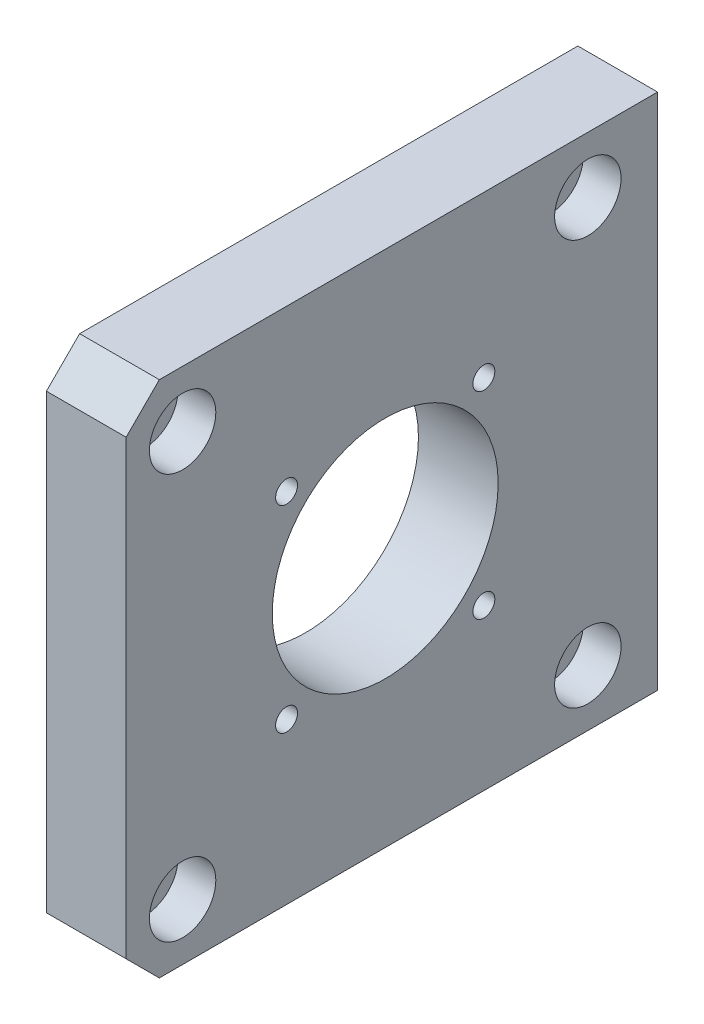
ISO-10303-21;
HEADER;
FILE_DESCRIPTION(('STEP AP214'),'2;1');
FILE_NAME('part.step','',(''),(''),'','','');
FILE_SCHEMA(('AUTOMOTIVE_DESIGN { 1 0 10303 214 1 1 1 1 }'));
ENDSEC;
DATA;
#1=APPLICATION_CONTEXT('core data for automotive mechanical design processes');
#2=APPLICATION_PROTOCOL_DEFINITION('international standard','automotive_design',2000,#1);
#3=PRODUCT_CONTEXT('',#1,'mechanical');
#4=PRODUCT('Part','Part','',(#3));
#5=PRODUCT_RELATED_PRODUCT_CATEGORY('part','',(#4));
#6=PRODUCT_DEFINITION_FORMATION('','',#4);
#7=PRODUCT_DEFINITION_CONTEXT('part definition',#1,'design');
#8=PRODUCT_DEFINITION('design','',#6,#7);
#9=PRODUCT_DEFINITION_SHAPE('','',#8);
#10=(LENGTH_UNIT() NAMED_UNIT(*) SI_UNIT(.MILLI.,.METRE.));
#11=(NAMED_UNIT(*) PLANE_ANGLE_UNIT() SI_UNIT($,.RADIAN.));
#12=(NAMED_UNIT(*) SI_UNIT($,.STERADIAN.) SOLID_ANGLE_UNIT());
#13=UNCERTAINTY_MEASURE_WITH_UNIT(LENGTH_MEASURE(1.E-05),#10,'distance_accuracy_value','');
#14=(GEOMETRIC_REPRESENTATION_CONTEXT(3) GLOBAL_UNCERTAINTY_ASSIGNED_CONTEXT((#13)) GLOBAL_UNIT_ASSIGNED_CONTEXT((#10,
#11,#12)) REPRESENTATION_CONTEXT('',''));
#15=CARTESIAN_POINT('',(0.,0.,0.));
#16=DIRECTION('',(0.,0.,1.));
#17=DIRECTION('',(1.,0.,0.));
#18=AXIS2_PLACEMENT_3D('',#15,#16,#17);
#19=CARTESIAN_POINT('',(-224.959018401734,-81.8968532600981,80.));
#20=DIRECTION('',(1.,0.,0.));
#21=DIRECTION('',(0.,0.,-1.));
#22=AXIS2_PLACEMENT_3D('',#19,#20,#21);
#23=PLANE('',#22);
#24=CARTESIAN_POINT('',(-224.959018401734,-12.3968532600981,71.5));
#25=DIRECTION('',(1.,0.,0.));
#26=DIRECTION('',(0.,0.,-1.));
#27=AXIS2_PLACEMENT_3D('',#24,#25,#26);
#28=CIRCLE('',#27,2.75);
#29=CARTESIAN_POINT('',(-224.959018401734,-12.3968532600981,68.75));
#30=VERTEX_POINT('',#29);
#31=EDGE_CURVE('E544',#30,#30,#28,.T.);
#32=ORIENTED_EDGE('',*,*,#31,.T.);
#33=EDGE_LOOP('',(#32));
#34=FACE_BOUND('',#33,.T.);
#35=CARTESIAN_POINT('',(-224.959018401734,-73.3968532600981,71.5));
#36=DIRECTION('',(1.,0.,0.));
#37=DIRECTION('',(0.,0.,-1.));
#38=AXIS2_PLACEMENT_3D('',#35,#36,#37);
#39=CIRCLE('',#38,2.75);
#40=CARTESIAN_POINT('',(-224.959018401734,-73.3968532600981,68.75));
#41=VERTEX_POINT('',#40);
#42=EDGE_CURVE('E532',#41,#41,#39,.T.);
#43=ORIENTED_EDGE('',*,*,#42,.T.);
#44=EDGE_LOOP('',(#43));
#45=FACE_BOUND('',#44,.T.);
#46=CARTESIAN_POINT('',(-224.959018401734,-73.3968532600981,10.5));
#47=DIRECTION('',(1.,0.,0.));
#48=DIRECTION('',(0.,0.,-1.));
#49=AXIS2_PLACEMENT_3D('',#46,#47,#48);
#50=CIRCLE('',#49,2.75);
#51=CARTESIAN_POINT('',(-224.959018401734,-73.3968532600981,7.75));
#52=VERTEX_POINT('',#51);
#53=EDGE_CURVE('E520',#52,#52,#50,.T.);
#54=ORIENTED_EDGE('',*,*,#53,.T.);
#55=EDGE_LOOP('',(#54));
#56=FACE_BOUND('',#55,.T.);
#57=CARTESIAN_POINT('',(-224.959018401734,-12.3968532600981,10.5));
#58=DIRECTION('',(1.,0.,0.));
#59=DIRECTION('',(0.,0.,-1.));
#60=AXIS2_PLACEMENT_3D('',#57,#58,#59);
#61=CIRCLE('',#60,2.75);
#62=CARTESIAN_POINT('',(-224.959018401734,-12.3968532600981,7.75));
#63=VERTEX_POINT('',#62);
#64=EDGE_CURVE('E508',#63,#63,#61,.T.);
#65=ORIENTED_EDGE('',*,*,#64,.T.);
#66=EDGE_LOOP('',(#65));
#67=FACE_BOUND('',#66,.T.);
#68=CARTESIAN_POINT('',(-224.959018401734,-28.0476108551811,55.8492422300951));
#69=DIRECTION('',(-1.,0.,0.));
#70=DIRECTION('',(0.,0.,1.));
#71=AXIS2_PLACEMENT_3D('',#68,#69,#70);
#72=CIRCLE('',#71,1.65);
#73=CARTESIAN_POINT('',(-224.959018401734,-28.0476108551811,57.4992422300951));
#74=VERTEX_POINT('',#73);
#75=EDGE_CURVE('E505',#74,#74,#72,.T.);
#76=ORIENTED_EDGE('',*,*,#75,.F.);
#77=EDGE_LOOP('',(#76));
#78=FACE_BOUND('',#77,.T.);
#79=CARTESIAN_POINT('',(-224.959018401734,-57.7460956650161,55.849242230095));
#80=DIRECTION('',(-1.,0.,0.));
#81=DIRECTION('',(0.,0.,1.));
#82=AXIS2_PLACEMENT_3D('',#79,#80,#81);
#83=CIRCLE('',#82,1.65);
#84=CARTESIAN_POINT('',(-224.959018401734,-57.7460956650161,57.499242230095));
#85=VERTEX_POINT('',#84);
#86=EDGE_CURVE('E499',#85,#85,#83,.T.);
#87=ORIENTED_EDGE('',*,*,#86,.F.);
#88=EDGE_LOOP('',(#87));
#89=FACE_BOUND('',#88,.T.);
#90=CARTESIAN_POINT('',(-224.959018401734,-28.047610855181,26.1507574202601));
#91=DIRECTION('',(-1.,0.,0.));
#92=DIRECTION('',(0.,0.,1.));
#93=AXIS2_PLACEMENT_3D('',#90,#91,#92);
#94=CIRCLE('',#93,1.65);
#95=CARTESIAN_POINT('',(-224.959018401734,-28.047610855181,27.8007574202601));
#96=VERTEX_POINT('',#95);
#97=EDGE_CURVE('E493',#96,#96,#94,.T.);
#98=ORIENTED_EDGE('',*,*,#97,.F.);
#99=EDGE_LOOP('',(#98));
#100=FACE_BOUND('',#99,.T.);
#101=CARTESIAN_POINT('',(-224.959018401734,-57.7460956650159,26.15075742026));
#102=DIRECTION('',(-1.,0.,0.));
#103=DIRECTION('',(0.,0.,1.));
#104=AXIS2_PLACEMENT_3D('',#101,#102,#103);
#105=CIRCLE('',#104,1.65);
#106=CARTESIAN_POINT('',(-224.959018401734,-57.7460956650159,27.80075742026));
#107=VERTEX_POINT('',#106);
#108=EDGE_CURVE('E485',#107,#107,#105,.T.);
#109=ORIENTED_EDGE('',*,*,#108,.F.);
#110=EDGE_LOOP('',(#109));
#111=FACE_BOUND('',#110,.T.);
#112=CARTESIAN_POINT('',(-224.959018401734,-42.8968532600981,41.));
#113=DIRECTION('',(1.,0.,0.));
#114=DIRECTION('',(0.,0.,-1.));
#115=AXIS2_PLACEMENT_3D('',#112,#113,#114);
#116=CIRCLE('',#115,17.);
#117=CARTESIAN_POINT('',(-224.959018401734,-42.8968532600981,24.));
#118=VERTEX_POINT('',#117);
#119=EDGE_CURVE('E93',#118,#118,#116,.T.);
#120=ORIENTED_EDGE('',*,*,#119,.T.);
#121=EDGE_LOOP('',(#120));
#122=FACE_BOUND('',#121,.T.);
#123=DIRECTION('',(0.,-1.,0.));
#124=VECTOR('',#123,1.);
#125=CARTESIAN_POINT('',(-224.959018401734,-81.8968532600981,80.));
#126=LINE('',#125,#124);
#127=CARTESIAN_POINT('',(-224.959018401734,-8.8968532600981,80.));
#128=VERTEX_POINT('',#127);
#129=CARTESIAN_POINT('',(-224.959018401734,-76.8968532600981,80.));
#130=VERTEX_POINT('',#129);
#131=EDGE_CURVE('E106',#128,#130,#126,.T.);
#132=ORIENTED_EDGE('',*,*,#131,.F.);
#133=DIRECTION('',(0.,-0.707106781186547,0.707106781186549));
#134=VECTOR('',#133,1.);
#135=CARTESIAN_POINT('',(-224.959018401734,-8.89685326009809,80.));
#136=LINE('',#135,#134);
#137=CARTESIAN_POINT('',(-224.959018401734,-3.89685326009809,75.));
#138=VERTEX_POINT('',#137);
#139=EDGE_CURVE('E139',#128,#138,#136,.F.);
#140=ORIENTED_EDGE('',*,*,#139,.T.);
#141=DIRECTION('',(0.,0.,-1.));
#142=VECTOR('',#141,1.);
#143=CARTESIAN_POINT('',(-224.959018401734,-3.89685326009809,80.));
#144=LINE('',#143,#142);
#145=CARTESIAN_POINT('',(-224.959018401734,-3.89685326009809,0.));
#146=VERTEX_POINT('',#145);
#147=EDGE_CURVE('E113',#138,#146,#144,.T.);
#148=ORIENTED_EDGE('',*,*,#147,.T.);
#149=DIRECTION('',(0.,-1.,0.));
#150=VECTOR('',#149,1.);
#151=CARTESIAN_POINT('',(-224.959018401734,-81.8968532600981,0.));
#152=LINE('',#151,#150);
#153=CARTESIAN_POINT('',(-224.959018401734,-81.8968532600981,0.));
#154=VERTEX_POINT('',#153);
#155=EDGE_CURVE('E105',#146,#154,#152,.T.);
#156=ORIENTED_EDGE('',*,*,#155,.T.);
#157=DIRECTION('',(0.,0.,-1.));
#158=VECTOR('',#157,1.);
#159=CARTESIAN_POINT('',(-224.959018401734,-81.8968532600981,80.));
#160=LINE('',#159,#158);
#161=CARTESIAN_POINT('',(-224.959018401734,-81.8968532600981,75.));
#162=VERTEX_POINT('',#161);
#163=EDGE_CURVE('E129',#162,#154,#160,.T.);
#164=ORIENTED_EDGE('',*,*,#163,.F.);
#165=DIRECTION('',(0.,-0.707106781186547,-0.707106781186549));
#166=VECTOR('',#165,1.);
#167=CARTESIAN_POINT('',(-224.959018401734,-76.8968532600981,80.));
#168=LINE('',#167,#166);
#169=EDGE_CURVE('E137',#162,#130,#168,.F.);
#170=ORIENTED_EDGE('',*,*,#169,.T.);
#171=EDGE_LOOP('',(#132,#140,#148,#156,#164,#170));
#172=FACE_BOUND('',#171,.T.);
#173=ADVANCED_FACE('F16',(#34,#45,#56,#67,#78,#89,#100,#111,#122,#172),#23,.F.);
#174=CARTESIAN_POINT('',(-224.959018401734,-81.8968532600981,80.));
#175=DIRECTION('',(0.,1.,0.));
#176=DIRECTION('',(0.,0.,1.));
#177=AXIS2_PLACEMENT_3D('',#174,#175,#176);
#178=PLANE('',#177);
#179=DIRECTION('',(0.,0.,-1.));
#180=VECTOR('',#179,1.);
#181=CARTESIAN_POINT('',(-212.959018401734,-81.8968532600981,80.));
#182=LINE('',#181,#180);
#183=CARTESIAN_POINT('',(-212.959018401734,-81.8968532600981,75.));
#184=VERTEX_POINT('',#183);
#185=CARTESIAN_POINT('',(-212.959018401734,-81.8968532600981,0.));
#186=VERTEX_POINT('',#185);
#187=EDGE_CURVE('E127',#184,#186,#182,.T.);
#188=ORIENTED_EDGE('',*,*,#187,.F.);
#189=DIRECTION('',(-1.,0.,0.));
#190=VECTOR('',#189,1.);
#191=CARTESIAN_POINT('',(-224.959018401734,-81.8968532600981,75.));
#192=LINE('',#191,#190);
#193=EDGE_CURVE('E11',#184,#162,#192,.T.);
#194=ORIENTED_EDGE('',*,*,#193,.T.);
#195=ORIENTED_EDGE('',*,*,#163,.T.);
#196=DIRECTION('',(1.,0.,0.));
#197=VECTOR('',#196,1.);
#198=CARTESIAN_POINT('',(-224.959018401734,-81.8968532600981,0.));
#199=LINE('',#198,#197);
#200=EDGE_CURVE('E116',#154,#186,#199,.T.);
#201=ORIENTED_EDGE('',*,*,#200,.T.);
#202=EDGE_LOOP('',(#188,#194,#195,#201));
#203=FACE_BOUND('',#202,.T.);
#204=ADVANCED_FACE('F164',(#203),#178,.F.);
#205=CARTESIAN_POINT('',(-212.959018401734,-81.8968532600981,80.));
#206=DIRECTION('',(-1.,0.,0.));
#207=DIRECTION('',(0.,0.,1.));
#208=AXIS2_PLACEMENT_3D('',#205,#206,#207);
#209=PLANE('',#208);
#210=CARTESIAN_POINT('',(-212.959018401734,-12.3968532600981,71.5));
#211=DIRECTION('',(1.,0.,0.));
#212=DIRECTION('',(0.,0.,-1.));
#213=AXIS2_PLACEMENT_3D('',#210,#211,#212);
#214=CIRCLE('',#213,5.);
#215=CARTESIAN_POINT('',(-212.959018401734,-12.3968532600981,66.5));
#216=VERTEX_POINT('',#215);
#217=EDGE_CURVE('E553',#216,#216,#214,.T.);
#218=ORIENTED_EDGE('',*,*,#217,.F.);
#219=EDGE_LOOP('',(#218));
#220=FACE_BOUND('',#219,.T.);
#221=CARTESIAN_POINT('',(-212.959018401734,-73.3968532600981,71.5));
#222=DIRECTION('',(1.,0.,0.));
#223=DIRECTION('',(0.,0.,-1.));
#224=AXIS2_PLACEMENT_3D('',#221,#222,#223);
#225=CIRCLE('',#224,5.);
#226=CARTESIAN_POINT('',(-212.959018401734,-73.3968532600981,66.5));
#227=VERTEX_POINT('',#226);
#228=EDGE_CURVE('E541',#227,#227,#225,.T.);
#229=ORIENTED_EDGE('',*,*,#228,.F.);
#230=EDGE_LOOP('',(#229));
#231=FACE_BOUND('',#230,.T.);
#232=CARTESIAN_POINT('',(-212.959018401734,-73.3968532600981,10.5));
#233=DIRECTION('',(1.,0.,0.));
#234=DIRECTION('',(0.,0.,-1.));
#235=AXIS2_PLACEMENT_3D('',#232,#233,#234);
#236=CIRCLE('',#235,5.);
#237=CARTESIAN_POINT('',(-212.959018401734,-73.3968532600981,5.5));
#238=VERTEX_POINT('',#237);
#239=EDGE_CURVE('E529',#238,#238,#236,.T.);
#240=ORIENTED_EDGE('',*,*,#239,.F.);
#241=EDGE_LOOP('',(#240));
#242=FACE_BOUND('',#241,.T.);
#243=CARTESIAN_POINT('',(-212.959018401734,-12.3968532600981,10.5));
#244=DIRECTION('',(1.,0.,0.));
#245=DIRECTION('',(0.,0.,-1.));
#246=AXIS2_PLACEMENT_3D('',#243,#244,#245);
#247=CIRCLE('',#246,5.);
#248=CARTESIAN_POINT('',(-212.959018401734,-12.3968532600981,5.5));
#249=VERTEX_POINT('',#248);
#250=EDGE_CURVE('E517',#249,#249,#247,.T.);
#251=ORIENTED_EDGE('',*,*,#250,.F.);
#252=EDGE_LOOP('',(#251));
#253=FACE_BOUND('',#252,.T.);
#254=CARTESIAN_POINT('',(-212.959018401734,-28.0476108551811,55.8492422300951));
#255=DIRECTION('',(-1.,0.,0.));
#256=DIRECTION('',(0.,0.,1.));
#257=AXIS2_PLACEMENT_3D('',#254,#255,#256);
#258=CIRCLE('',#257,1.65);
#259=CARTESIAN_POINT('',(-212.959018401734,-28.0476108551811,57.4992422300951));
#260=VERTEX_POINT('',#259);
#261=EDGE_CURVE('E502',#260,#260,#258,.T.);
#262=ORIENTED_EDGE('',*,*,#261,.T.);
#263=EDGE_LOOP('',(#262));
#264=FACE_BOUND('',#263,.T.);
#265=CARTESIAN_POINT('',(-212.959018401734,-57.7460956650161,55.849242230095));
#266=DIRECTION('',(-1.,0.,0.));
#267=DIRECTION('',(0.,0.,1.));
#268=AXIS2_PLACEMENT_3D('',#265,#266,#267);
#269=CIRCLE('',#268,1.65);
#270=CARTESIAN_POINT('',(-212.959018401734,-57.7460956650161,57.499242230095));
#271=VERTEX_POINT('',#270);
#272=EDGE_CURVE('E496',#271,#271,#269,.T.);
#273=ORIENTED_EDGE('',*,*,#272,.T.);
#274=EDGE_LOOP('',(#273));
#275=FACE_BOUND('',#274,.T.);
#276=CARTESIAN_POINT('',(-212.959018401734,-28.047610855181,26.1507574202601));
#277=DIRECTION('',(-1.,0.,0.));
#278=DIRECTION('',(0.,0.,1.));
#279=AXIS2_PLACEMENT_3D('',#276,#277,#278);
#280=CIRCLE('',#279,1.65);
#281=CARTESIAN_POINT('',(-212.959018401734,-28.047610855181,27.8007574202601));
#282=VERTEX_POINT('',#281);
#283=EDGE_CURVE('E490',#282,#282,#280,.T.);
#284=ORIENTED_EDGE('',*,*,#283,.T.);
#285=EDGE_LOOP('',(#284));
#286=FACE_BOUND('',#285,.T.);
#287=CARTESIAN_POINT('',(-212.959018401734,-57.7460956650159,26.15075742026));
#288=DIRECTION('',(-1.,0.,0.));
#289=DIRECTION('',(0.,0.,1.));
#290=AXIS2_PLACEMENT_3D('',#287,#288,#289);
#291=CIRCLE('',#290,1.65);
#292=CARTESIAN_POINT('',(-212.959018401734,-57.7460956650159,27.80075742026));
#293=VERTEX_POINT('',#292);
#294=EDGE_CURVE('E482',#293,#293,#291,.T.);
#295=ORIENTED_EDGE('',*,*,#294,.T.);
#296=EDGE_LOOP('',(#295));
#297=FACE_BOUND('',#296,.T.);
#298=CARTESIAN_POINT('',(-212.959018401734,-42.8968532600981,41.));
#299=DIRECTION('',(1.,0.,0.));
#300=DIRECTION('',(0.,0.,-1.));
#301=AXIS2_PLACEMENT_3D('',#298,#299,#300);
#302=CIRCLE('',#301,17.);
#303=CARTESIAN_POINT('',(-212.959018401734,-42.8968532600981,24.));
#304=VERTEX_POINT('',#303);
#305=EDGE_CURVE('E480',#304,#304,#302,.T.);
#306=ORIENTED_EDGE('',*,*,#305,.F.);
#307=EDGE_LOOP('',(#306));
#308=FACE_BOUND('',#307,.T.);
#309=DIRECTION('',(0.,0.,-1.));
#310=VECTOR('',#309,1.);
#311=CARTESIAN_POINT('',(-212.959018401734,-3.89685326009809,80.));
#312=LINE('',#311,#310);
#313=CARTESIAN_POINT('',(-212.959018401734,-3.89685326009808,75.));
#314=VERTEX_POINT('',#313);
#315=CARTESIAN_POINT('',(-212.959018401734,-3.89685326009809,0.));
#316=VERTEX_POINT('',#315);
#317=EDGE_CURVE('E125',#314,#316,#312,.T.);
#318=ORIENTED_EDGE('',*,*,#317,.F.);
#319=DIRECTION('',(0.,0.707106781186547,-0.707106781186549));
#320=VECTOR('',#319,1.);
#321=CARTESIAN_POINT('',(-212.959018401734,-8.89685326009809,80.));
#322=LINE('',#321,#320);
#323=CARTESIAN_POINT('',(-212.959018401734,-8.8968532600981,80.));
#324=VERTEX_POINT('',#323);
#325=EDGE_CURVE('E24',#314,#324,#322,.F.);
#326=ORIENTED_EDGE('',*,*,#325,.T.);
#327=DIRECTION('',(0.,1.,0.));
#328=VECTOR('',#327,1.);
#329=CARTESIAN_POINT('',(-212.959018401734,-81.8968532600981,80.));
#330=LINE('',#329,#328);
#331=CARTESIAN_POINT('',(-212.959018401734,-76.8968532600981,80.));
#332=VERTEX_POINT('',#331);
#333=EDGE_CURVE('E109',#332,#324,#330,.T.);
#334=ORIENTED_EDGE('',*,*,#333,.F.);
#335=DIRECTION('',(0.,0.707106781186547,0.707106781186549));
#336=VECTOR('',#335,1.);
#337=CARTESIAN_POINT('',(-212.959018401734,-76.8968532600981,80.));
#338=LINE('',#337,#336);
#339=EDGE_CURVE('E31',#332,#184,#338,.F.);
#340=ORIENTED_EDGE('',*,*,#339,.T.);
#341=ORIENTED_EDGE('',*,*,#187,.T.);
#342=DIRECTION('',(0.,1.,0.));
#343=VECTOR('',#342,1.);
#344=CARTESIAN_POINT('',(-212.959018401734,-81.8968532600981,0.));
#345=LINE('',#344,#343);
#346=EDGE_CURVE('E119',#186,#316,#345,.T.);
#347=ORIENTED_EDGE('',*,*,#346,.T.);
#348=EDGE_LOOP('',(#318,#326,#334,#340,#341,#347));
#349=FACE_BOUND('',#348,.T.);
#350=ADVANCED_FACE('F143',(#220,#231,#242,#253,#264,#275,#286,#297,#308,#349),#209,.F.);
#351=CARTESIAN_POINT('',(-224.959018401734,-3.89685326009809,80.));
#352=DIRECTION('',(0.,-1.,0.));
#353=DIRECTION('',(0.,0.,-1.));
#354=AXIS2_PLACEMENT_3D('',#351,#352,#353);
#355=PLANE('',#354);
#356=ORIENTED_EDGE('',*,*,#147,.F.);
#357=DIRECTION('',(1.,0.,0.));
#358=VECTOR('',#357,1.);
#359=CARTESIAN_POINT('',(-224.959018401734,-3.89685326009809,75.));
#360=LINE('',#359,#358);
#361=EDGE_CURVE('E39',#138,#314,#360,.T.);
#362=ORIENTED_EDGE('',*,*,#361,.T.);
#363=ORIENTED_EDGE('',*,*,#317,.T.);
#364=DIRECTION('',(-1.,0.,0.));
#365=VECTOR('',#364,1.);
#366=CARTESIAN_POINT('',(-224.959018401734,-3.89685326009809,0.));
#367=LINE('',#366,#365);
#368=EDGE_CURVE('E110',#316,#146,#367,.T.);
#369=ORIENTED_EDGE('',*,*,#368,.T.);
#370=EDGE_LOOP('',(#356,#362,#363,#369));
#371=FACE_BOUND('',#370,.T.);
#372=ADVANCED_FACE('F152',(#371),#355,.F.);
#373=CARTESIAN_POINT('',(0.,0.,80.));
#374=DIRECTION('',(0.,0.,-1.));
#375=DIRECTION('',(-1.,0.,0.));
#376=AXIS2_PLACEMENT_3D('',#373,#374,#375);
#377=PLANE('',#376);
#378=ORIENTED_EDGE('',*,*,#333,.T.);
#379=DIRECTION('',(-1.,0.,0.));
#380=VECTOR('',#379,1.);
#381=CARTESIAN_POINT('',(0.,-8.89685326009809,80.));
#382=LINE('',#381,#380);
#383=EDGE_CURVE('E134',#324,#128,#382,.T.);
#384=ORIENTED_EDGE('',*,*,#383,.T.);
#385=ORIENTED_EDGE('',*,*,#131,.T.);
#386=DIRECTION('',(1.,0.,0.));
#387=VECTOR('',#386,1.);
#388=CARTESIAN_POINT('',(0.,-76.8968532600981,80.));
#389=LINE('',#388,#387);
#390=EDGE_CURVE('E131',#130,#332,#389,.T.);
#391=ORIENTED_EDGE('',*,*,#390,.T.);
#392=EDGE_LOOP('',(#378,#384,#385,#391));
#393=FACE_BOUND('',#392,.T.);
#394=ADVANCED_FACE('F147',(#393),#377,.F.);
#395=CARTESIAN_POINT('',(0.,0.,0.));
#396=DIRECTION('',(0.,0.,-1.));
#397=DIRECTION('',(-1.,0.,0.));
#398=AXIS2_PLACEMENT_3D('',#395,#396,#397);
#399=PLANE('',#398);
#400=CARTESIAN_POINT('',(-218.959018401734,-21.8968524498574,0.));
#401=DIRECTION('',(0.,0.,-1.));
#402=DIRECTION('',(-1.,0.,0.));
#403=AXIS2_PLACEMENT_3D('',#400,#401,#402);
#404=CIRCLE('',#403,2.5);
#405=CARTESIAN_POINT('',(-221.459018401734,-21.8968524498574,0.));
#406=VERTEX_POINT('',#405);
#407=EDGE_CURVE('E87',#406,#406,#404,.T.);
#408=ORIENTED_EDGE('',*,*,#407,.F.);
#409=EDGE_LOOP('',(#408));
#410=FACE_BOUND('',#409,.T.);
#411=CARTESIAN_POINT('',(-218.959018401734,-41.8968524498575,0.));
#412=DIRECTION('',(0.,0.,-1.));
#413=DIRECTION('',(-1.,0.,0.));
#414=AXIS2_PLACEMENT_3D('',#411,#412,#413);
#415=CIRCLE('',#414,2.5);
#416=CARTESIAN_POINT('',(-221.459018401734,-41.8968524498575,0.));
#417=VERTEX_POINT('',#416);
#418=EDGE_CURVE('E86',#417,#417,#415,.T.);
#419=ORIENTED_EDGE('',*,*,#418,.F.);
#420=EDGE_LOOP('',(#419));
#421=FACE_BOUND('',#420,.T.);
#422=CARTESIAN_POINT('',(-218.959018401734,-65.8968524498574,0.));
#423=DIRECTION('',(0.,0.,-1.));
#424=DIRECTION('',(-1.,0.,0.));
#425=AXIS2_PLACEMENT_3D('',#422,#423,#424);
#426=CIRCLE('',#425,2.5);
#427=CARTESIAN_POINT('',(-221.459018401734,-65.8968524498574,0.));
#428=VERTEX_POINT('',#427);
#429=EDGE_CURVE('E99',#428,#428,#426,.T.);
#430=ORIENTED_EDGE('',*,*,#429,.F.);
#431=EDGE_LOOP('',(#430));
#432=FACE_BOUND('',#431,.T.);
#433=ORIENTED_EDGE('',*,*,#155,.F.);
#434=ORIENTED_EDGE('',*,*,#368,.F.);
#435=ORIENTED_EDGE('',*,*,#346,.F.);
#436=ORIENTED_EDGE('',*,*,#200,.F.);
#437=EDGE_LOOP('',(#433,#434,#435,#436));
#438=FACE_BOUND('',#437,.T.);
#439=ADVANCED_FACE('F158',(#410,#421,#432,#438),#399,.T.);
#440=CARTESIAN_POINT('',(-218.959018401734,-65.8968524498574,15.));
#441=DIRECTION('',(0.,0.,-1.));
#442=DIRECTION('',(-1.,0.,0.));
#443=AXIS2_PLACEMENT_3D('',#440,#441,#442);
#444=CONICAL_SURFACE('',#443,2.5,1.02974425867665);
#445=CARTESIAN_POINT('',(-218.959018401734,-65.8968524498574,16.5021515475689));
#446=VERTEX_POINT('',#445);
#447=VERTEX_LOOP('',#446);
#448=FACE_BOUND('',#447,.T.);
#449=CARTESIAN_POINT('',(-218.959018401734,-65.8968524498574,15.));
#450=DIRECTION('',(0.,0.,-1.));
#451=DIRECTION('',(-1.,0.,0.));
#452=AXIS2_PLACEMENT_3D('',#449,#450,#451);
#453=CIRCLE('',#452,2.5);
#454=CARTESIAN_POINT('',(-221.459018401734,-65.8968524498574,15.));
#455=VERTEX_POINT('',#454);
#456=EDGE_CURVE('E102',#455,#455,#453,.T.);
#457=ORIENTED_EDGE('',*,*,#456,.T.);
#458=EDGE_LOOP('',(#457));
#459=FACE_BOUND('',#458,.T.);
#460=ADVANCED_FACE('F269',(#448,#459),#444,.F.);
#461=CARTESIAN_POINT('',(-218.959018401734,-65.8968524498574,0.));
#462=DIRECTION('',(0.,0.,-1.));
#463=DIRECTION('',(-1.,0.,0.));
#464=AXIS2_PLACEMENT_3D('',#461,#462,#463);
#465=CYLINDRICAL_SURFACE('',#464,2.5);
#466=ORIENTED_EDGE('',*,*,#456,.F.);
#467=EDGE_LOOP('',(#466));
#468=FACE_BOUND('',#467,.T.);
#469=ORIENTED_EDGE('',*,*,#429,.T.);
#470=EDGE_LOOP('',(#469));
#471=FACE_BOUND('',#470,.T.);
#472=ADVANCED_FACE('F265',(#468,#471),#465,.F.);
#473=CARTESIAN_POINT('',(-218.959018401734,-41.8968524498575,15.));
#474=DIRECTION('',(0.,0.,-1.));
#475=DIRECTION('',(-1.,0.,0.));
#476=AXIS2_PLACEMENT_3D('',#473,#474,#475);
#477=CONICAL_SURFACE('',#476,2.5,1.02974425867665);
#478=CARTESIAN_POINT('',(-218.959018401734,-41.8968524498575,16.5021515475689));
#479=VERTEX_POINT('',#478);
#480=VERTEX_LOOP('',#479);
#481=FACE_BOUND('',#480,.T.);
#482=CARTESIAN_POINT('',(-218.959018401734,-41.8968524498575,15.));
#483=DIRECTION('',(0.,0.,-1.));
#484=DIRECTION('',(-1.,0.,0.));
#485=AXIS2_PLACEMENT_3D('',#482,#483,#484);
#486=CIRCLE('',#485,2.5);
#487=CARTESIAN_POINT('',(-221.459018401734,-41.8968524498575,15.));
#488=VERTEX_POINT('',#487);
#489=EDGE_CURVE('E90',#488,#488,#486,.T.);
#490=ORIENTED_EDGE('',*,*,#489,.T.);
#491=EDGE_LOOP('',(#490));
#492=FACE_BOUND('',#491,.T.);
#493=ADVANCED_FACE('F261',(#481,#492),#477,.F.);
#494=CARTESIAN_POINT('',(-218.959018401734,-41.8968524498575,0.));
#495=DIRECTION('',(0.,0.,-1.));
#496=DIRECTION('',(-1.,0.,0.));
#497=AXIS2_PLACEMENT_3D('',#494,#495,#496);
#498=CYLINDRICAL_SURFACE('',#497,2.5);
#499=ORIENTED_EDGE('',*,*,#489,.F.);
#500=EDGE_LOOP('',(#499));
#501=FACE_BOUND('',#500,.T.);
#502=ORIENTED_EDGE('',*,*,#418,.T.);
#503=EDGE_LOOP('',(#502));
#504=FACE_BOUND('',#503,.T.);
#505=ADVANCED_FACE('F80',(#501,#504),#498,.F.);
#506=CARTESIAN_POINT('',(-218.959018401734,-21.8968524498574,15.));
#507=DIRECTION('',(0.,0.,-1.));
#508=DIRECTION('',(-1.,0.,0.));
#509=AXIS2_PLACEMENT_3D('',#506,#507,#508);
#510=CONICAL_SURFACE('',#509,2.5,1.02974425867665);
#511=CARTESIAN_POINT('',(-218.959018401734,-21.8968524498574,16.5021515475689));
#512=VERTEX_POINT('',#511);
#513=VERTEX_LOOP('',#512);
#514=FACE_BOUND('',#513,.T.);
#515=CARTESIAN_POINT('',(-218.959018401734,-21.8968524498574,15.));
#516=DIRECTION('',(0.,0.,-1.));
#517=DIRECTION('',(-1.,0.,0.));
#518=AXIS2_PLACEMENT_3D('',#515,#516,#517);
#519=CIRCLE('',#518,2.5);
#520=CARTESIAN_POINT('',(-221.459018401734,-21.8968524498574,15.));
#521=VERTEX_POINT('',#520);
#522=EDGE_CURVE('E84',#521,#521,#519,.T.);
#523=ORIENTED_EDGE('',*,*,#522,.T.);
#524=EDGE_LOOP('',(#523));
#525=FACE_BOUND('',#524,.T.);
#526=ADVANCED_FACE('F76',(#514,#525),#510,.F.);
#527=CARTESIAN_POINT('',(-218.959018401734,-21.8968524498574,0.));
#528=DIRECTION('',(0.,0.,-1.));
#529=DIRECTION('',(-1.,0.,0.));
#530=AXIS2_PLACEMENT_3D('',#527,#528,#529);
#531=CYLINDRICAL_SURFACE('',#530,2.5);
#532=ORIENTED_EDGE('',*,*,#522,.F.);
#533=EDGE_LOOP('',(#532));
#534=FACE_BOUND('',#533,.T.);
#535=ORIENTED_EDGE('',*,*,#407,.T.);
#536=EDGE_LOOP('',(#535));
#537=FACE_BOUND('',#536,.T.);
#538=ADVANCED_FACE('F79',(#534,#537),#531,.F.);
#539=CARTESIAN_POINT('',(-224.959018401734,-42.8968532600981,41.));
#540=DIRECTION('',(1.,0.,0.));
#541=DIRECTION('',(0.,0.,-1.));
#542=AXIS2_PLACEMENT_3D('',#539,#540,#541);
#543=CYLINDRICAL_SURFACE('',#542,17.);
#544=ORIENTED_EDGE('',*,*,#119,.F.);
#545=EDGE_LOOP('',(#544));
#546=FACE_BOUND('',#545,.T.);
#547=ORIENTED_EDGE('',*,*,#305,.T.);
#548=EDGE_LOOP('',(#547));
#549=FACE_BOUND('',#548,.T.);
#550=ADVANCED_FACE('F252',(#546,#549),#543,.F.);
#551=CARTESIAN_POINT('',(-224.959018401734,-57.7460956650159,26.15075742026));
#552=DIRECTION('',(-1.,0.,0.));
#553=DIRECTION('',(0.,0.,1.));
#554=AXIS2_PLACEMENT_3D('',#551,#552,#553);
#555=CYLINDRICAL_SURFACE('',#554,1.65);
#556=ORIENTED_EDGE('',*,*,#294,.F.);
#557=EDGE_LOOP('',(#556));
#558=FACE_BOUND('',#557,.T.);
#559=ORIENTED_EDGE('',*,*,#108,.T.);
#560=EDGE_LOOP('',(#559));
#561=FACE_BOUND('',#560,.T.);
#562=ADVANCED_FACE('F248',(#558,#561),#555,.F.);
#563=CARTESIAN_POINT('',(-224.959018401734,-28.047610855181,26.1507574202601));
#564=DIRECTION('',(-1.,0.,0.));
#565=DIRECTION('',(0.,0.,1.));
#566=AXIS2_PLACEMENT_3D('',#563,#564,#565);
#567=CYLINDRICAL_SURFACE('',#566,1.65);
#568=ORIENTED_EDGE('',*,*,#283,.F.);
#569=EDGE_LOOP('',(#568));
#570=FACE_BOUND('',#569,.T.);
#571=ORIENTED_EDGE('',*,*,#97,.T.);
#572=EDGE_LOOP('',(#571));
#573=FACE_BOUND('',#572,.T.);
#574=ADVANCED_FACE('F244',(#570,#573),#567,.F.);
#575=CARTESIAN_POINT('',(-224.959018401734,-57.7460956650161,55.849242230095));
#576=DIRECTION('',(-1.,0.,0.));
#577=DIRECTION('',(0.,0.,1.));
#578=AXIS2_PLACEMENT_3D('',#575,#576,#577);
#579=CYLINDRICAL_SURFACE('',#578,1.65);
#580=ORIENTED_EDGE('',*,*,#272,.F.);
#581=EDGE_LOOP('',(#580));
#582=FACE_BOUND('',#581,.T.);
#583=ORIENTED_EDGE('',*,*,#86,.T.);
#584=EDGE_LOOP('',(#583));
#585=FACE_BOUND('',#584,.T.);
#586=ADVANCED_FACE('F240',(#582,#585),#579,.F.);
#587=CARTESIAN_POINT('',(-224.959018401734,-28.0476108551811,55.8492422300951));
#588=DIRECTION('',(-1.,0.,0.));
#589=DIRECTION('',(0.,0.,1.));
#590=AXIS2_PLACEMENT_3D('',#587,#588,#589);
#591=CYLINDRICAL_SURFACE('',#590,1.65);
#592=ORIENTED_EDGE('',*,*,#261,.F.);
#593=EDGE_LOOP('',(#592));
#594=FACE_BOUND('',#593,.T.);
#595=ORIENTED_EDGE('',*,*,#75,.T.);
#596=EDGE_LOOP('',(#595));
#597=FACE_BOUND('',#596,.T.);
#598=ADVANCED_FACE('F236',(#594,#597),#591,.F.);
#599=CARTESIAN_POINT('',(-212.959018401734,-12.3968532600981,10.5));
#600=DIRECTION('',(1.,0.,0.));
#601=DIRECTION('',(0.,0.,-1.));
#602=AXIS2_PLACEMENT_3D('',#599,#600,#601);
#603=CYLINDRICAL_SURFACE('',#602,2.75);
#604=ORIENTED_EDGE('',*,*,#64,.F.);
#605=EDGE_LOOP('',(#604));
#606=FACE_BOUND('',#605,.T.);
#607=CARTESIAN_POINT('',(-218.659018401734,-12.3968532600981,10.5));
#608=DIRECTION('',(1.,0.,0.));
#609=DIRECTION('',(0.,0.,-1.));
#610=AXIS2_PLACEMENT_3D('',#607,#608,#609);
#611=CIRCLE('',#610,2.75);
#612=CARTESIAN_POINT('',(-218.659018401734,-12.3968532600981,7.75));
#613=VERTEX_POINT('',#612);
#614=EDGE_CURVE('E511',#613,#613,#611,.T.);
#615=ORIENTED_EDGE('',*,*,#614,.T.);
#616=EDGE_LOOP('',(#615));
#617=FACE_BOUND('',#616,.T.);
#618=ADVANCED_FACE('F232',(#606,#617),#603,.F.);
#619=CARTESIAN_POINT('',(-218.659018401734,-9.64685326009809,10.5));
#620=DIRECTION('',(-1.,0.,0.));
#621=DIRECTION('',(0.,0.,1.));
#622=AXIS2_PLACEMENT_3D('',#619,#620,#621);
#623=PLANE('',#622);
#624=ORIENTED_EDGE('',*,*,#614,.F.);
#625=EDGE_LOOP('',(#624));
#626=FACE_BOUND('',#625,.T.);
#627=CARTESIAN_POINT('',(-218.659018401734,-12.3968532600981,10.5));
#628=DIRECTION('',(1.,0.,0.));
#629=DIRECTION('',(0.,0.,-1.));
#630=AXIS2_PLACEMENT_3D('',#627,#628,#629);
#631=CIRCLE('',#630,5.);
#632=CARTESIAN_POINT('',(-218.659018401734,-12.3968532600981,5.5));
#633=VERTEX_POINT('',#632);
#634=EDGE_CURVE('E514',#633,#633,#631,.T.);
#635=ORIENTED_EDGE('',*,*,#634,.T.);
#636=EDGE_LOOP('',(#635));
#637=FACE_BOUND('',#636,.T.);
#638=ADVANCED_FACE('F228',(#626,#637),#623,.F.);
#639=CARTESIAN_POINT('',(-212.959018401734,-12.3968532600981,10.5));
#640=DIRECTION('',(1.,0.,0.));
#641=DIRECTION('',(0.,0.,-1.));
#642=AXIS2_PLACEMENT_3D('',#639,#640,#641);
#643=CYLINDRICAL_SURFACE('',#642,5.);
#644=ORIENTED_EDGE('',*,*,#634,.F.);
#645=EDGE_LOOP('',(#644));
#646=FACE_BOUND('',#645,.T.);
#647=ORIENTED_EDGE('',*,*,#250,.T.);
#648=EDGE_LOOP('',(#647));
#649=FACE_BOUND('',#648,.T.);
#650=ADVANCED_FACE('F224',(#646,#649),#643,.F.);
#651=CARTESIAN_POINT('',(-212.959018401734,-73.3968532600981,10.5));
#652=DIRECTION('',(1.,0.,0.));
#653=DIRECTION('',(0.,0.,-1.));
#654=AXIS2_PLACEMENT_3D('',#651,#652,#653);
#655=CYLINDRICAL_SURFACE('',#654,2.75);
#656=ORIENTED_EDGE('',*,*,#53,.F.);
#657=EDGE_LOOP('',(#656));
#658=FACE_BOUND('',#657,.T.);
#659=CARTESIAN_POINT('',(-218.659018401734,-73.3968532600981,10.5));
#660=DIRECTION('',(1.,0.,0.));
#661=DIRECTION('',(0.,0.,-1.));
#662=AXIS2_PLACEMENT_3D('',#659,#660,#661);
#663=CIRCLE('',#662,2.75);
#664=CARTESIAN_POINT('',(-218.659018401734,-73.3968532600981,7.75));
#665=VERTEX_POINT('',#664);
#666=EDGE_CURVE('E523',#665,#665,#663,.T.);
#667=ORIENTED_EDGE('',*,*,#666,.T.);
#668=EDGE_LOOP('',(#667));
#669=FACE_BOUND('',#668,.T.);
#670=ADVANCED_FACE('F220',(#658,#669),#655,.F.);
#671=CARTESIAN_POINT('',(-218.659018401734,-70.6468532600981,10.5));
#672=DIRECTION('',(-1.,0.,0.));
#673=DIRECTION('',(0.,0.,1.));
#674=AXIS2_PLACEMENT_3D('',#671,#672,#673);
#675=PLANE('',#674);
#676=ORIENTED_EDGE('',*,*,#666,.F.);
#677=EDGE_LOOP('',(#676));
#678=FACE_BOUND('',#677,.T.);
#679=CARTESIAN_POINT('',(-218.659018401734,-73.3968532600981,10.5));
#680=DIRECTION('',(1.,0.,0.));
#681=DIRECTION('',(0.,0.,-1.));
#682=AXIS2_PLACEMENT_3D('',#679,#680,#681);
#683=CIRCLE('',#682,5.);
#684=CARTESIAN_POINT('',(-218.659018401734,-73.3968532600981,5.5));
#685=VERTEX_POINT('',#684);
#686=EDGE_CURVE('E526',#685,#685,#683,.T.);
#687=ORIENTED_EDGE('',*,*,#686,.T.);
#688=EDGE_LOOP('',(#687));
#689=FACE_BOUND('',#688,.T.);
#690=ADVANCED_FACE('F216',(#678,#689),#675,.F.);
#691=CARTESIAN_POINT('',(-212.959018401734,-73.3968532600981,10.5));
#692=DIRECTION('',(1.,0.,0.));
#693=DIRECTION('',(0.,0.,-1.));
#694=AXIS2_PLACEMENT_3D('',#691,#692,#693);
#695=CYLINDRICAL_SURFACE('',#694,5.);
#696=ORIENTED_EDGE('',*,*,#686,.F.);
#697=EDGE_LOOP('',(#696));
#698=FACE_BOUND('',#697,.T.);
#699=ORIENTED_EDGE('',*,*,#239,.T.);
#700=EDGE_LOOP('',(#699));
#701=FACE_BOUND('',#700,.T.);
#702=ADVANCED_FACE('F212',(#698,#701),#695,.F.);
#703=CARTESIAN_POINT('',(-212.959018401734,-73.3968532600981,71.5));
#704=DIRECTION('',(1.,0.,0.));
#705=DIRECTION('',(0.,0.,-1.));
#706=AXIS2_PLACEMENT_3D('',#703,#704,#705);
#707=CYLINDRICAL_SURFACE('',#706,2.75);
#708=ORIENTED_EDGE('',*,*,#42,.F.);
#709=EDGE_LOOP('',(#708));
#710=FACE_BOUND('',#709,.T.);
#711=CARTESIAN_POINT('',(-218.659018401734,-73.3968532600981,71.5));
#712=DIRECTION('',(1.,0.,0.));
#713=DIRECTION('',(0.,0.,-1.));
#714=AXIS2_PLACEMENT_3D('',#711,#712,#713);
#715=CIRCLE('',#714,2.75);
#716=CARTESIAN_POINT('',(-218.659018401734,-73.3968532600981,68.75));
#717=VERTEX_POINT('',#716);
#718=EDGE_CURVE('E535',#717,#717,#715,.T.);
#719=ORIENTED_EDGE('',*,*,#718,.T.);
#720=EDGE_LOOP('',(#719));
#721=FACE_BOUND('',#720,.T.);
#722=ADVANCED_FACE('F208',(#710,#721),#707,.F.);
#723=CARTESIAN_POINT('',(-218.659018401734,-70.6468532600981,71.5));
#724=DIRECTION('',(-1.,0.,0.));
#725=DIRECTION('',(0.,0.,1.));
#726=AXIS2_PLACEMENT_3D('',#723,#724,#725);
#727=PLANE('',#726);
#728=ORIENTED_EDGE('',*,*,#718,.F.);
#729=EDGE_LOOP('',(#728));
#730=FACE_BOUND('',#729,.T.);
#731=CARTESIAN_POINT('',(-218.659018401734,-73.3968532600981,71.5));
#732=DIRECTION('',(1.,0.,0.));
#733=DIRECTION('',(0.,0.,-1.));
#734=AXIS2_PLACEMENT_3D('',#731,#732,#733);
#735=CIRCLE('',#734,5.);
#736=CARTESIAN_POINT('',(-218.659018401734,-73.3968532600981,66.5));
#737=VERTEX_POINT('',#736);
#738=EDGE_CURVE('E538',#737,#737,#735,.T.);
#739=ORIENTED_EDGE('',*,*,#738,.T.);
#740=EDGE_LOOP('',(#739));
#741=FACE_BOUND('',#740,.T.);
#742=ADVANCED_FACE('F204',(#730,#741),#727,.F.);
#743=CARTESIAN_POINT('',(-212.959018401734,-73.3968532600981,71.5));
#744=DIRECTION('',(1.,0.,0.));
#745=DIRECTION('',(0.,0.,-1.));
#746=AXIS2_PLACEMENT_3D('',#743,#744,#745);
#747=CYLINDRICAL_SURFACE('',#746,5.);
#748=ORIENTED_EDGE('',*,*,#738,.F.);
#749=EDGE_LOOP('',(#748));
#750=FACE_BOUND('',#749,.T.);
#751=ORIENTED_EDGE('',*,*,#228,.T.);
#752=EDGE_LOOP('',(#751));
#753=FACE_BOUND('',#752,.T.);
#754=ADVANCED_FACE('F200',(#750,#753),#747,.F.);
#755=CARTESIAN_POINT('',(-212.959018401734,-12.3968532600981,71.5));
#756=DIRECTION('',(1.,0.,0.));
#757=DIRECTION('',(0.,0.,-1.));
#758=AXIS2_PLACEMENT_3D('',#755,#756,#757);
#759=CYLINDRICAL_SURFACE('',#758,2.75);
#760=ORIENTED_EDGE('',*,*,#31,.F.);
#761=EDGE_LOOP('',(#760));
#762=FACE_BOUND('',#761,.T.);
#763=CARTESIAN_POINT('',(-218.659018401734,-12.3968532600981,71.5));
#764=DIRECTION('',(1.,0.,0.));
#765=DIRECTION('',(0.,0.,-1.));
#766=AXIS2_PLACEMENT_3D('',#763,#764,#765);
#767=CIRCLE('',#766,2.75);
#768=CARTESIAN_POINT('',(-218.659018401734,-12.3968532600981,68.75));
#769=VERTEX_POINT('',#768);
#770=EDGE_CURVE('E547',#769,#769,#767,.T.);
#771=ORIENTED_EDGE('',*,*,#770,.T.);
#772=EDGE_LOOP('',(#771));
#773=FACE_BOUND('',#772,.T.);
#774=ADVANCED_FACE('F192',(#762,#773),#759,.F.);
#775=CARTESIAN_POINT('',(-218.659018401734,-9.64685326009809,71.5));
#776=DIRECTION('',(-1.,0.,0.));
#777=DIRECTION('',(0.,0.,1.));
#778=AXIS2_PLACEMENT_3D('',#775,#776,#777);
#779=PLANE('',#778);
#780=ORIENTED_EDGE('',*,*,#770,.F.);
#781=EDGE_LOOP('',(#780));
#782=FACE_BOUND('',#781,.T.);
#783=CARTESIAN_POINT('',(-218.659018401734,-12.3968532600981,71.5));
#784=DIRECTION('',(1.,0.,0.));
#785=DIRECTION('',(0.,0.,-1.));
#786=AXIS2_PLACEMENT_3D('',#783,#784,#785);
#787=CIRCLE('',#786,5.);
#788=CARTESIAN_POINT('',(-218.659018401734,-12.3968532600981,66.5));
#789=VERTEX_POINT('',#788);
#790=EDGE_CURVE('E550',#789,#789,#787,.T.);
#791=ORIENTED_EDGE('',*,*,#790,.T.);
#792=EDGE_LOOP('',(#791));
#793=FACE_BOUND('',#792,.T.);
#794=ADVANCED_FACE('F185',(#782,#793),#779,.F.);
#795=CARTESIAN_POINT('',(-212.959018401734,-12.3968532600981,71.5));
#796=DIRECTION('',(1.,0.,0.));
#797=DIRECTION('',(0.,0.,-1.));
#798=AXIS2_PLACEMENT_3D('',#795,#796,#797);
#799=CYLINDRICAL_SURFACE('',#798,5.);
#800=ORIENTED_EDGE('',*,*,#790,.F.);
#801=EDGE_LOOP('',(#800));
#802=FACE_BOUND('',#801,.T.);
#803=ORIENTED_EDGE('',*,*,#217,.T.);
#804=EDGE_LOOP('',(#803));
#805=FACE_BOUND('',#804,.T.);
#806=ADVANCED_FACE('F179',(#802,#805),#799,.F.);
#807=CARTESIAN_POINT('',(0.,-8.89685326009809,80.));
#808=DIRECTION('',(0.,-0.707106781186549,-0.707106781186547));
#809=DIRECTION('',(-1.,0.,0.));
#810=AXIS2_PLACEMENT_3D('',#807,#808,#809);
#811=PLANE('',#810);
#812=ORIENTED_EDGE('',*,*,#325,.F.);
#813=ORIENTED_EDGE('',*,*,#361,.F.);
#814=ORIENTED_EDGE('',*,*,#139,.F.);
#815=ORIENTED_EDGE('',*,*,#383,.F.);
#816=EDGE_LOOP('',(#812,#813,#814,#815));
#817=FACE_BOUND('',#816,.T.);
#818=ADVANCED_FACE('F150',(#817),#811,.F.);
#819=CARTESIAN_POINT('',(0.,-76.8968532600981,80.));
#820=DIRECTION('',(0.,0.707106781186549,-0.707106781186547));
#821=DIRECTION('',(1.,0.,0.));
#822=AXIS2_PLACEMENT_3D('',#819,#820,#821);
#823=PLANE('',#822);
#824=ORIENTED_EDGE('',*,*,#169,.F.);
#825=ORIENTED_EDGE('',*,*,#193,.F.);
#826=ORIENTED_EDGE('',*,*,#339,.F.);
#827=ORIENTED_EDGE('',*,*,#390,.F.);
#828=EDGE_LOOP('',(#824,#825,#826,#827));
#829=FACE_BOUND('',#828,.T.);
#830=ADVANCED_FACE('F18',(#829),#823,.F.);
#831=CLOSED_SHELL('',(#173,#204,#350,#372,#394,#439,#460,#472,#493,#505,#526,#538,#550,#562,
#574,#586,#598,#618,#638,#650,#670,#690,#702,#722,#742,#754,#774,#794,#806,#818,#830));
#832=MANIFOLD_SOLID_BREP('B1',#831);
#833=ADVANCED_BREP_SHAPE_REPRESENTATION('',(#18,#832),#14);
#834=SHAPE_DEFINITION_REPRESENTATION(#9,#833);
ENDSEC;
END-ISO-10303-21;
